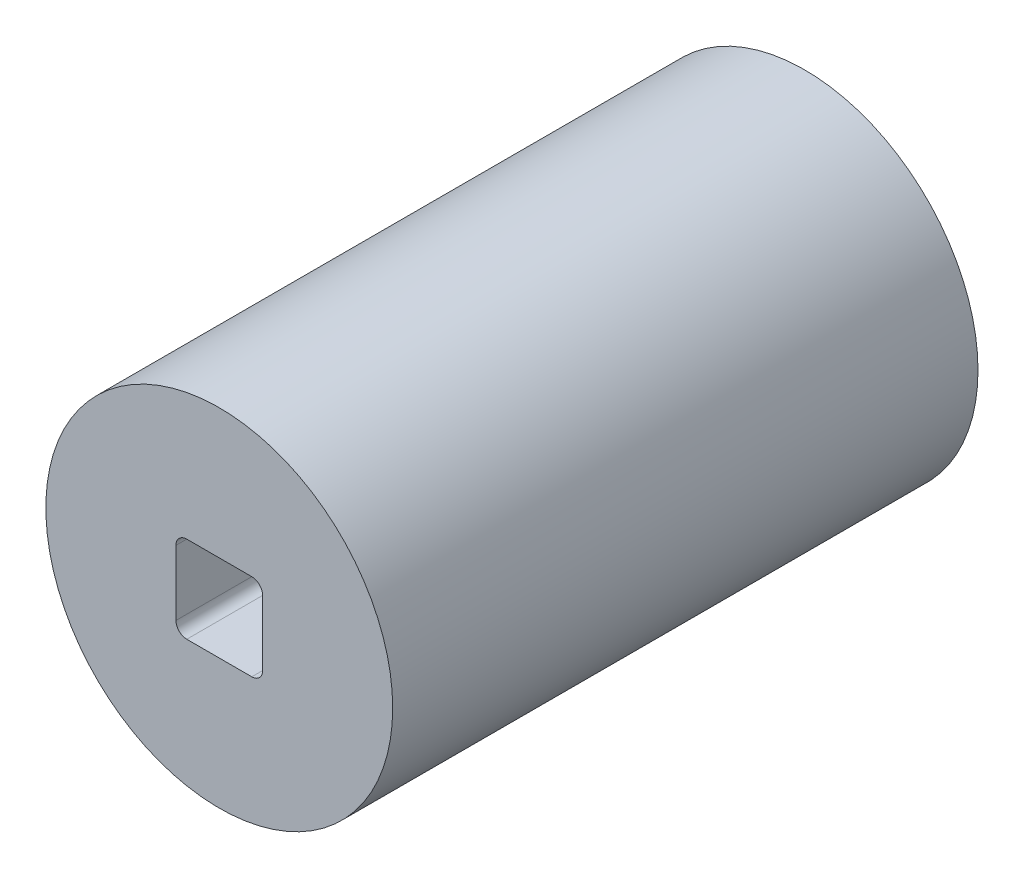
from build123d import *

# Parameters (mm, degrees)
SKETCH1_R           = 406.4
BOSS_EXTRUDE1_DEPTH = 1371.6
CUT_EXTRUDE1_DEPTH  = 1330.325
CUT_EXTRUDE2_DEPTH  = 19.05


with BuildPart() as part:
    # Sketch1 → Boss-Extrude1 (new body)
    with BuildSketch(Plane(origin=(0, 0, 0), x_dir=(0, 1, 0), z_dir=(0, 0, 1))):
        with Locations(Location((0, 0, 0), (0, 0, 270))):
            Circle(SKETCH1_R)
    extrude(amount=-BOSS_EXTRUDE1_DEPTH)

    # Sketch3 → Cut-Extrude1 (cut)
    # profile 1 of 2: a face of its own
    with BuildSketch(Plane(origin=(0, 0, 0), x_dir=(0, 1, 0), z_dir=(0, 0, 1))):
        with BuildLine():
            Line((76.2, 101.6), (-76.2, 101.6))
            ThreePointArc((-76.2, 101.6), (-94.160512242, 94.160512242), (-101.6, 76.2))
            Line((-101.6, 76.2), (-101.6, -76.2))
            ThreePointArc((-101.6, -76.2), (-94.160512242, -94.160512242), (-76.2, -101.6))
            Line((-76.2, -101.6), (76.2, -101.6))
            ThreePointArc((76.2, -101.6), (94.160512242, -94.160512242), (101.6, -76.2))
            Line((101.6, -76.2), (101.6, 76.2))
            ThreePointArc((101.6, 76.2), (94.160512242, 94.160512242), (76.2, 101.6))
        make_face()
        with BuildLine():
            ThreePointArc((-88.9, -76.2), (-85.180256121, -85.180256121), (-76.2, -88.9))
            Line((-76.2, -88.9), (76.2, -88.9))
            ThreePointArc((76.2, -88.9), (85.180256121, -85.180256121), (88.9, -76.2))
            Line((88.9, -76.2), (88.9, 76.2))
            ThreePointArc((88.9, 76.2), (85.180256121, 85.180256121), (76.2, 88.9))
            Line((76.2, 88.9), (-76.2, 88.9))
            ThreePointArc((-76.2, 88.9), (-85.180256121, 85.180256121), (-88.9, 76.2))
            Line((-88.9, 76.2), (-88.9, -76.2))
        make_face(mode=Mode.SUBTRACT)
    # profile 2 of 2: a face of its own
    with BuildSketch(Plane(origin=(0, 0, 0), x_dir=(0, 1, 0), z_dir=(0, 0, 1))):
        with BuildLine():
            Line((-88.9, -76.2), (-88.9, 76.2))
            ThreePointArc((-88.9, 76.2), (-85.180256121, 85.180256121), (-76.2, 88.9))
            Line((-76.2, 88.9), (76.2, 88.9))
            ThreePointArc((76.2, 88.9), (85.180256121, 85.180256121), (88.9, 76.2))
            Line((88.9, 76.2), (88.9, -76.2))
            ThreePointArc((88.9, -76.2), (85.180256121, -85.180256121), (76.2, -88.9))
            Line((76.2, -88.9), (-76.2, -88.9))
            ThreePointArc((-76.2, -88.9), (-85.180256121, -85.180256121), (-88.9, -76.2))
        make_face()
    extrude(amount=-CUT_EXTRUDE1_DEPTH, mode=Mode.SUBTRACT)

    # Sketch4 → Cut-Extrude2 (cut)
    with BuildSketch(Plane(origin=(0, 0, -1330.325), x_dir=(0, -1, 0), z_dir=(0, 0, 1))):
        Polygon((131.982271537, -228.6), (263.964543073, 0), (131.982271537, 228.6), (-131.982271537, 228.6), (-263.964543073, 0), (-131.982271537, -228.6), align=None)
    extrude(amount=CUT_EXTRUDE2_DEPTH, mode=Mode.SUBTRACT)


solid = part.part
